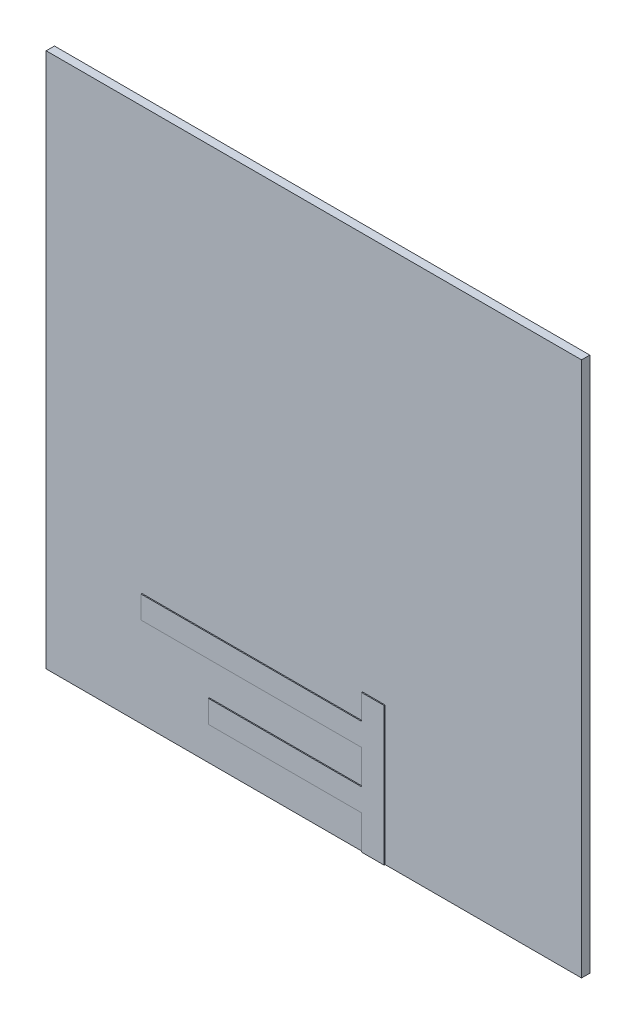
ISO-10303-21;
HEADER;
FILE_DESCRIPTION(('STEP AP214'),'2;1');
FILE_NAME('part.step','',(''),(''),'','','');
FILE_SCHEMA(('AUTOMOTIVE_DESIGN { 1 0 10303 214 1 1 1 1 }'));
ENDSEC;
DATA;
#1=APPLICATION_CONTEXT('core data for automotive mechanical design processes');
#2=APPLICATION_PROTOCOL_DEFINITION('international standard','automotive_design',2000,#1);
#3=PRODUCT_CONTEXT('',#1,'mechanical');
#4=PRODUCT('Part','Part','',(#3));
#5=PRODUCT_RELATED_PRODUCT_CATEGORY('part','',(#4));
#6=PRODUCT_DEFINITION_FORMATION('','',#4);
#7=PRODUCT_DEFINITION_CONTEXT('part definition',#1,'design');
#8=PRODUCT_DEFINITION('design','',#6,#7);
#9=PRODUCT_DEFINITION_SHAPE('','',#8);
#10=(LENGTH_UNIT() NAMED_UNIT(*) SI_UNIT(.MILLI.,.METRE.));
#11=(NAMED_UNIT(*) PLANE_ANGLE_UNIT() SI_UNIT($,.RADIAN.));
#12=(NAMED_UNIT(*) SI_UNIT($,.STERADIAN.) SOLID_ANGLE_UNIT());
#13=UNCERTAINTY_MEASURE_WITH_UNIT(LENGTH_MEASURE(1.E-05),#10,'distance_accuracy_value','');
#14=(GEOMETRIC_REPRESENTATION_CONTEXT(3) GLOBAL_UNCERTAINTY_ASSIGNED_CONTEXT((#13)) GLOBAL_UNIT_ASSIGNED_CONTEXT((#10,
#11,#12)) REPRESENTATION_CONTEXT('',''));
#15=CARTESIAN_POINT('',(0.,0.,0.));
#16=DIRECTION('',(0.,0.,1.));
#17=DIRECTION('',(1.,0.,0.));
#18=AXIS2_PLACEMENT_3D('',#15,#16,#17);
#19=CARTESIAN_POINT('',(-55.,55.,1.9));
#20=DIRECTION('',(1.,0.,0.));
#21=DIRECTION('',(0.,1.,0.));
#22=AXIS2_PLACEMENT_3D('',#19,#20,#21);
#23=PLANE('',#22);
#24=DIRECTION('',(0.,0.,-1.));
#25=VECTOR('',#24,1.);
#26=CARTESIAN_POINT('',(-55.,-55.,1.9));
#27=LINE('',#26,#25);
#28=CARTESIAN_POINT('',(-55.,-55.,1.7));
#29=VERTEX_POINT('',#28);
#30=CARTESIAN_POINT('',(-55.,-55.,0.));
#31=VERTEX_POINT('',#30);
#32=EDGE_CURVE('E11',#29,#31,#27,.T.);
#33=ORIENTED_EDGE('',*,*,#32,.F.);
#34=DIRECTION('',(0.,-1.,0.));
#35=VECTOR('',#34,1.);
#36=CARTESIAN_POINT('',(-55.,-55.,1.7));
#37=LINE('',#36,#35);
#38=CARTESIAN_POINT('',(-55.,55.,1.7));
#39=VERTEX_POINT('',#38);
#40=EDGE_CURVE('E224',#39,#29,#37,.T.);
#41=ORIENTED_EDGE('',*,*,#40,.F.);
#42=DIRECTION('',(0.,0.,-1.));
#43=VECTOR('',#42,1.);
#44=CARTESIAN_POINT('',(-55.,55.,1.9));
#45=LINE('',#44,#43);
#46=CARTESIAN_POINT('',(-55.,55.,0.));
#47=VERTEX_POINT('',#46);
#48=EDGE_CURVE('E61',#39,#47,#45,.T.);
#49=ORIENTED_EDGE('',*,*,#48,.T.);
#50=DIRECTION('',(0.,-1.,0.));
#51=VECTOR('',#50,1.);
#52=CARTESIAN_POINT('',(-55.,55.,0.));
#53=LINE('',#52,#51);
#54=EDGE_CURVE('E268',#47,#31,#53,.T.);
#55=ORIENTED_EDGE('',*,*,#54,.T.);
#56=EDGE_LOOP('',(#33,#41,#49,#55));
#57=FACE_BOUND('',#56,.T.);
#58=ADVANCED_FACE('F38',(#57),#23,.F.);
#59=CARTESIAN_POINT('',(-55.,-55.,1.9));
#60=DIRECTION('',(0.,1.,0.));
#61=DIRECTION('',(0.,0.,1.));
#62=AXIS2_PLACEMENT_3D('',#59,#60,#61);
#63=PLANE('',#62);
#64=DIRECTION('',(1.,0.,0.));
#65=VECTOR('',#64,1.);
#66=CARTESIAN_POINT('',(55.,-55.,1.7));
#67=LINE('',#66,#65);
#68=CARTESIAN_POINT('',(14.63,-55.,1.7));
#69=VERTEX_POINT('',#68);
#70=CARTESIAN_POINT('',(55.,-55.,1.7));
#71=VERTEX_POINT('',#70);
#72=EDGE_CURVE('E215',#69,#71,#67,.T.);
#73=ORIENTED_EDGE('',*,*,#72,.F.);
#74=DIRECTION('',(0.,0.,1.));
#75=VECTOR('',#74,1.);
#76=CARTESIAN_POINT('',(14.63,-55.,1.7));
#77=LINE('',#76,#75);
#78=CARTESIAN_POINT('',(14.63,-55.,1.9));
#79=VERTEX_POINT('',#78);
#80=EDGE_CURVE('E269',#69,#79,#77,.T.);
#81=ORIENTED_EDGE('',*,*,#80,.T.);
#82=DIRECTION('',(1.,0.,0.));
#83=VECTOR('',#82,1.);
#84=CARTESIAN_POINT('',(-55.,-55.,1.9));
#85=LINE('',#84,#83);
#86=CARTESIAN_POINT('',(9.99999999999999,-55.,1.9));
#87=VERTEX_POINT('',#86);
#88=EDGE_CURVE('E299',#87,#79,#85,.T.);
#89=ORIENTED_EDGE('',*,*,#88,.F.);
#90=DIRECTION('',(0.,0.,1.));
#91=VECTOR('',#90,1.);
#92=CARTESIAN_POINT('',(9.99999999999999,-55.,1.7));
#93=LINE('',#92,#91);
#94=CARTESIAN_POINT('',(9.99999999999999,-55.,1.7));
#95=VERTEX_POINT('',#94);
#96=EDGE_CURVE('E265',#95,#87,#93,.T.);
#97=ORIENTED_EDGE('',*,*,#96,.F.);
#98=DIRECTION('',(1.,0.,0.));
#99=VECTOR('',#98,1.);
#100=CARTESIAN_POINT('',(9.99999999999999,-55.,1.7));
#101=LINE('',#100,#99);
#102=EDGE_CURVE('E160',#29,#95,#101,.T.);
#103=ORIENTED_EDGE('',*,*,#102,.F.);
#104=ORIENTED_EDGE('',*,*,#32,.T.);
#105=DIRECTION('',(1.,0.,0.));
#106=VECTOR('',#105,1.);
#107=CARTESIAN_POINT('',(-55.,-55.,0.));
#108=LINE('',#107,#106);
#109=CARTESIAN_POINT('',(55.,-55.,0.));
#110=VERTEX_POINT('',#109);
#111=EDGE_CURVE('E306',#31,#110,#108,.T.);
#112=ORIENTED_EDGE('',*,*,#111,.T.);
#113=DIRECTION('',(0.,0.,-1.));
#114=VECTOR('',#113,1.);
#115=CARTESIAN_POINT('',(55.,-55.,1.9));
#116=LINE('',#115,#114);
#117=EDGE_CURVE('E46',#71,#110,#116,.T.);
#118=ORIENTED_EDGE('',*,*,#117,.F.);
#119=EDGE_LOOP('',(#73,#81,#89,#97,#103,#104,#112,#118));
#120=FACE_BOUND('',#119,.T.);
#121=ADVANCED_FACE('F331',(#120),#63,.F.);
#122=CARTESIAN_POINT('',(55.,55.,1.9));
#123=DIRECTION('',(-1.,0.,0.));
#124=DIRECTION('',(0.,-1.,0.));
#125=AXIS2_PLACEMENT_3D('',#122,#123,#124);
#126=PLANE('',#125);
#127=DIRECTION('',(0.,0.,-1.));
#128=VECTOR('',#127,1.);
#129=CARTESIAN_POINT('',(55.,55.,1.9));
#130=LINE('',#129,#128);
#131=CARTESIAN_POINT('',(55.,55.,1.7));
#132=VERTEX_POINT('',#131);
#133=CARTESIAN_POINT('',(55.,55.,0.));
#134=VERTEX_POINT('',#133);
#135=EDGE_CURVE('E318',#132,#134,#130,.T.);
#136=ORIENTED_EDGE('',*,*,#135,.F.);
#137=DIRECTION('',(0.,1.,0.));
#138=VECTOR('',#137,1.);
#139=CARTESIAN_POINT('',(55.,55.,1.7));
#140=LINE('',#139,#138);
#141=EDGE_CURVE('E218',#71,#132,#140,.T.);
#142=ORIENTED_EDGE('',*,*,#141,.F.);
#143=ORIENTED_EDGE('',*,*,#117,.T.);
#144=DIRECTION('',(0.,1.,0.));
#145=VECTOR('',#144,1.);
#146=CARTESIAN_POINT('',(55.,55.,0.));
#147=LINE('',#146,#145);
#148=EDGE_CURVE('E310',#110,#134,#147,.T.);
#149=ORIENTED_EDGE('',*,*,#148,.T.);
#150=EDGE_LOOP('',(#136,#142,#143,#149));
#151=FACE_BOUND('',#150,.T.);
#152=ADVANCED_FACE('F325',(#151),#126,.F.);
#153=CARTESIAN_POINT('',(-55.,55.,1.9));
#154=DIRECTION('',(0.,-1.,0.));
#155=DIRECTION('',(0.,0.,-1.));
#156=AXIS2_PLACEMENT_3D('',#153,#154,#155);
#157=PLANE('',#156);
#158=ORIENTED_EDGE('',*,*,#48,.F.);
#159=DIRECTION('',(-1.,0.,0.));
#160=VECTOR('',#159,1.);
#161=CARTESIAN_POINT('',(-55.,55.,1.7));
#162=LINE('',#161,#160);
#163=EDGE_CURVE('E221',#132,#39,#162,.T.);
#164=ORIENTED_EDGE('',*,*,#163,.F.);
#165=ORIENTED_EDGE('',*,*,#135,.T.);
#166=DIRECTION('',(-1.,0.,0.));
#167=VECTOR('',#166,1.);
#168=CARTESIAN_POINT('',(-55.,55.,0.));
#169=LINE('',#168,#167);
#170=EDGE_CURVE('E303',#134,#47,#169,.T.);
#171=ORIENTED_EDGE('',*,*,#170,.T.);
#172=EDGE_LOOP('',(#158,#164,#165,#171));
#173=FACE_BOUND('',#172,.T.);
#174=ADVANCED_FACE('F337',(#173),#157,.F.);
#175=CARTESIAN_POINT('',(0.,0.,1.9));
#176=DIRECTION('',(0.,0.,1.));
#177=DIRECTION('',(1.,0.,0.));
#178=AXIS2_PLACEMENT_3D('',#175,#176,#177);
#179=PLANE('',#178);
#180=DIRECTION('',(0.,1.,0.));
#181=VECTOR('',#180,1.);
#182=CARTESIAN_POINT('',(9.99999999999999,-48.005,1.9));
#183=LINE('',#182,#181);
#184=CARTESIAN_POINT('',(9.99999999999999,-48.005,1.9));
#185=VERTEX_POINT('',#184);
#186=EDGE_CURVE('E53',#87,#185,#183,.T.);
#187=ORIENTED_EDGE('',*,*,#186,.F.);
#188=ORIENTED_EDGE('',*,*,#88,.T.);
#189=DIRECTION('',(0.,-1.,0.));
#190=VECTOR('',#189,1.);
#191=CARTESIAN_POINT('',(14.63,-55.,1.9));
#192=LINE('',#191,#190);
#193=CARTESIAN_POINT('',(14.63,-26.5961070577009,1.9));
#194=VERTEX_POINT('',#193);
#195=EDGE_CURVE('E175',#194,#79,#192,.T.);
#196=ORIENTED_EDGE('',*,*,#195,.F.);
#197=DIRECTION('',(1.,0.,0.));
#198=VECTOR('',#197,1.);
#199=CARTESIAN_POINT('',(14.63,-26.5961070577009,1.9));
#200=LINE('',#199,#198);
#201=CARTESIAN_POINT('',(9.99999999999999,-26.5961070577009,1.9));
#202=VERTEX_POINT('',#201);
#203=EDGE_CURVE('E178',#202,#194,#200,.T.);
#204=ORIENTED_EDGE('',*,*,#203,.F.);
#205=DIRECTION('',(0.,1.,0.));
#206=VECTOR('',#205,1.);
#207=CARTESIAN_POINT('',(9.99999999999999,-26.5961070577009,1.9));
#208=LINE('',#207,#206);
#209=CARTESIAN_POINT('',(9.99999999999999,-31.735,1.9));
#210=VERTEX_POINT('',#209);
#211=EDGE_CURVE('E258',#210,#202,#208,.T.);
#212=ORIENTED_EDGE('',*,*,#211,.F.);
#213=DIRECTION('',(1.,0.,0.));
#214=VECTOR('',#213,1.);
#215=CARTESIAN_POINT('',(9.99999999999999,-31.735,1.9));
#216=LINE('',#215,#214);
#217=CARTESIAN_POINT('',(-35.33,-31.735,1.9));
#218=VERTEX_POINT('',#217);
#219=EDGE_CURVE('E254',#218,#210,#216,.T.);
#220=ORIENTED_EDGE('',*,*,#219,.F.);
#221=DIRECTION('',(0.,1.,0.));
#222=VECTOR('',#221,1.);
#223=CARTESIAN_POINT('',(-35.33,-31.735,1.9));
#224=LINE('',#223,#222);
#225=CARTESIAN_POINT('',(-35.33,-36.365,1.9));
#226=VERTEX_POINT('',#225);
#227=EDGE_CURVE('E250',#226,#218,#224,.T.);
#228=ORIENTED_EDGE('',*,*,#227,.F.);
#229=DIRECTION('',(-1.,0.,0.));
#230=VECTOR('',#229,1.);
#231=CARTESIAN_POINT('',(-35.33,-36.365,1.9));
#232=LINE('',#231,#230);
#233=CARTESIAN_POINT('',(10.,-36.365,1.9));
#234=VERTEX_POINT('',#233);
#235=EDGE_CURVE('E246',#234,#226,#232,.T.);
#236=ORIENTED_EDGE('',*,*,#235,.F.);
#237=DIRECTION('',(0.,1.,0.));
#238=VECTOR('',#237,1.);
#239=CARTESIAN_POINT('',(10.,-36.365,1.9));
#240=LINE('',#239,#238);
#241=CARTESIAN_POINT('',(9.99999999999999,-43.375,1.9));
#242=VERTEX_POINT('',#241);
#243=EDGE_CURVE('E242',#242,#234,#240,.T.);
#244=ORIENTED_EDGE('',*,*,#243,.F.);
#245=DIRECTION('',(1.,0.,0.));
#246=VECTOR('',#245,1.);
#247=CARTESIAN_POINT('',(9.99999999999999,-43.375,1.9));
#248=LINE('',#247,#246);
#249=CARTESIAN_POINT('',(-21.48,-43.375,1.9));
#250=VERTEX_POINT('',#249);
#251=EDGE_CURVE('E238',#250,#242,#248,.T.);
#252=ORIENTED_EDGE('',*,*,#251,.F.);
#253=DIRECTION('',(0.,1.,0.));
#254=VECTOR('',#253,1.);
#255=CARTESIAN_POINT('',(-21.48,-43.375,1.9));
#256=LINE('',#255,#254);
#257=CARTESIAN_POINT('',(-21.48,-48.005,1.9));
#258=VERTEX_POINT('',#257);
#259=EDGE_CURVE('E234',#258,#250,#256,.T.);
#260=ORIENTED_EDGE('',*,*,#259,.F.);
#261=DIRECTION('',(-1.,0.,0.));
#262=VECTOR('',#261,1.);
#263=CARTESIAN_POINT('',(-21.48,-48.005,1.9));
#264=LINE('',#263,#262);
#265=EDGE_CURVE('E231',#185,#258,#264,.T.);
#266=ORIENTED_EDGE('',*,*,#265,.F.);
#267=EDGE_LOOP('',(#187,#188,#196,#204,#212,#220,#228,#236,#244,#252,#260,#266));
#268=FACE_BOUND('',#267,.T.);
#269=ADVANCED_FACE('F350',(#268),#179,.T.);
#270=CARTESIAN_POINT('',(0.,0.,0.));
#271=DIRECTION('',(0.,0.,1.));
#272=DIRECTION('',(1.,0.,0.));
#273=AXIS2_PLACEMENT_3D('',#270,#271,#272);
#274=PLANE('',#273);
#275=ORIENTED_EDGE('',*,*,#54,.F.);
#276=ORIENTED_EDGE('',*,*,#170,.F.);
#277=ORIENTED_EDGE('',*,*,#148,.F.);
#278=ORIENTED_EDGE('',*,*,#111,.F.);
#279=EDGE_LOOP('',(#275,#276,#277,#278));
#280=FACE_BOUND('',#279,.T.);
#281=ADVANCED_FACE('F335',(#280),#274,.F.);
#282=CARTESIAN_POINT('',(9.99999999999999,-48.005,1.7));
#283=DIRECTION('',(1.,0.,0.));
#284=DIRECTION('',(0.,0.,-1.));
#285=AXIS2_PLACEMENT_3D('',#282,#283,#284);
#286=PLANE('',#285);
#287=ORIENTED_EDGE('',*,*,#186,.T.);
#288=DIRECTION('',(0.,0.,1.));
#289=VECTOR('',#288,1.);
#290=CARTESIAN_POINT('',(9.99999999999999,-48.005,1.7));
#291=LINE('',#290,#289);
#292=CARTESIAN_POINT('',(9.99999999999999,-48.005,1.7));
#293=VERTEX_POINT('',#292);
#294=EDGE_CURVE('E149',#293,#185,#291,.T.);
#295=ORIENTED_EDGE('',*,*,#294,.F.);
#296=DIRECTION('',(0.,1.,0.));
#297=VECTOR('',#296,1.);
#298=CARTESIAN_POINT('',(9.99999999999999,-48.005,1.7));
#299=LINE('',#298,#297);
#300=EDGE_CURVE('E153',#95,#293,#299,.T.);
#301=ORIENTED_EDGE('',*,*,#300,.F.);
#302=ORIENTED_EDGE('',*,*,#96,.T.);
#303=EDGE_LOOP('',(#287,#295,#301,#302));
#304=FACE_BOUND('',#303,.T.);
#305=ADVANCED_FACE('F151',(#304),#286,.F.);
#306=CARTESIAN_POINT('',(14.63,-55.,1.7));
#307=DIRECTION('',(-1.,0.,0.));
#308=DIRECTION('',(0.,0.,1.));
#309=AXIS2_PLACEMENT_3D('',#306,#307,#308);
#310=PLANE('',#309);
#311=ORIENTED_EDGE('',*,*,#195,.T.);
#312=ORIENTED_EDGE('',*,*,#80,.F.);
#313=DIRECTION('',(0.,-1.,0.));
#314=VECTOR('',#313,1.);
#315=CARTESIAN_POINT('',(14.63,-55.,1.7));
#316=LINE('',#315,#314);
#317=CARTESIAN_POINT('',(14.63,-26.5961070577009,1.7));
#318=VERTEX_POINT('',#317);
#319=EDGE_CURVE('E211',#318,#69,#316,.T.);
#320=ORIENTED_EDGE('',*,*,#319,.F.);
#321=DIRECTION('',(0.,0.,1.));
#322=VECTOR('',#321,1.);
#323=CARTESIAN_POINT('',(14.63,-26.5961070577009,1.7));
#324=LINE('',#323,#322);
#325=EDGE_CURVE('E273',#318,#194,#324,.T.);
#326=ORIENTED_EDGE('',*,*,#325,.T.);
#327=EDGE_LOOP('',(#311,#312,#320,#326));
#328=FACE_BOUND('',#327,.T.);
#329=ADVANCED_FACE('F358',(#328),#310,.F.);
#330=CARTESIAN_POINT('',(14.63,-26.5961070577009,1.7));
#331=DIRECTION('',(0.,-1.,0.));
#332=DIRECTION('',(0.,0.,-1.));
#333=AXIS2_PLACEMENT_3D('',#330,#331,#332);
#334=PLANE('',#333);
#335=ORIENTED_EDGE('',*,*,#203,.T.);
#336=ORIENTED_EDGE('',*,*,#325,.F.);
#337=DIRECTION('',(1.,0.,0.));
#338=VECTOR('',#337,1.);
#339=CARTESIAN_POINT('',(14.63,-26.5961070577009,1.7));
#340=LINE('',#339,#338);
#341=CARTESIAN_POINT('',(9.99999999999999,-26.5961070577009,1.7));
#342=VERTEX_POINT('',#341);
#343=EDGE_CURVE('E207',#342,#318,#340,.T.);
#344=ORIENTED_EDGE('',*,*,#343,.F.);
#345=DIRECTION('',(0.,0.,1.));
#346=VECTOR('',#345,1.);
#347=CARTESIAN_POINT('',(9.99999999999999,-26.5961070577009,1.7));
#348=LINE('',#347,#346);
#349=EDGE_CURVE('E276',#342,#202,#348,.T.);
#350=ORIENTED_EDGE('',*,*,#349,.T.);
#351=EDGE_LOOP('',(#335,#336,#344,#350));
#352=FACE_BOUND('',#351,.T.);
#353=ADVANCED_FACE('F388',(#352),#334,.F.);
#354=CARTESIAN_POINT('',(9.99999999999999,-26.5961070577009,1.7));
#355=DIRECTION('',(1.,0.,0.));
#356=DIRECTION('',(0.,0.,-1.));
#357=AXIS2_PLACEMENT_3D('',#354,#355,#356);
#358=PLANE('',#357);
#359=ORIENTED_EDGE('',*,*,#211,.T.);
#360=ORIENTED_EDGE('',*,*,#349,.F.);
#361=DIRECTION('',(0.,1.,0.));
#362=VECTOR('',#361,1.);
#363=CARTESIAN_POINT('',(9.99999999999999,-26.5961070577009,1.7));
#364=LINE('',#363,#362);
#365=CARTESIAN_POINT('',(9.99999999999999,-31.735,1.7));
#366=VERTEX_POINT('',#365);
#367=EDGE_CURVE('E203',#366,#342,#364,.T.);
#368=ORIENTED_EDGE('',*,*,#367,.F.);
#369=DIRECTION('',(0.,0.,1.));
#370=VECTOR('',#369,1.);
#371=CARTESIAN_POINT('',(9.99999999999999,-31.735,1.7));
#372=LINE('',#371,#370);
#373=EDGE_CURVE('E279',#366,#210,#372,.T.);
#374=ORIENTED_EDGE('',*,*,#373,.T.);
#375=EDGE_LOOP('',(#359,#360,#368,#374));
#376=FACE_BOUND('',#375,.T.);
#377=ADVANCED_FACE('F384',(#376),#358,.F.);
#378=CARTESIAN_POINT('',(9.99999999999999,-31.735,1.7));
#379=DIRECTION('',(0.,-1.,0.));
#380=DIRECTION('',(1.,0.,0.));
#381=AXIS2_PLACEMENT_3D('',#378,#379,#380);
#382=PLANE('',#381);
#383=ORIENTED_EDGE('',*,*,#219,.T.);
#384=ORIENTED_EDGE('',*,*,#373,.F.);
#385=DIRECTION('',(1.,0.,0.));
#386=VECTOR('',#385,1.);
#387=CARTESIAN_POINT('',(9.99999999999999,-31.735,1.7));
#388=LINE('',#387,#386);
#389=CARTESIAN_POINT('',(-35.33,-31.735,1.7));
#390=VERTEX_POINT('',#389);
#391=EDGE_CURVE('E199',#390,#366,#388,.T.);
#392=ORIENTED_EDGE('',*,*,#391,.F.);
#393=DIRECTION('',(0.,0.,1.));
#394=VECTOR('',#393,1.);
#395=CARTESIAN_POINT('',(-35.33,-31.735,1.7));
#396=LINE('',#395,#394);
#397=EDGE_CURVE('E282',#390,#218,#396,.T.);
#398=ORIENTED_EDGE('',*,*,#397,.T.);
#399=EDGE_LOOP('',(#383,#384,#392,#398));
#400=FACE_BOUND('',#399,.T.);
#401=ADVANCED_FACE('F380',(#400),#382,.F.);
#402=CARTESIAN_POINT('',(-35.33,-31.735,1.7));
#403=DIRECTION('',(1.,0.,0.));
#404=DIRECTION('',(0.,0.,-1.));
#405=AXIS2_PLACEMENT_3D('',#402,#403,#404);
#406=PLANE('',#405);
#407=ORIENTED_EDGE('',*,*,#227,.T.);
#408=ORIENTED_EDGE('',*,*,#397,.F.);
#409=DIRECTION('',(0.,1.,0.));
#410=VECTOR('',#409,1.);
#411=CARTESIAN_POINT('',(-35.33,-31.735,1.7));
#412=LINE('',#411,#410);
#413=CARTESIAN_POINT('',(-35.33,-36.365,1.7));
#414=VERTEX_POINT('',#413);
#415=EDGE_CURVE('E195',#414,#390,#412,.T.);
#416=ORIENTED_EDGE('',*,*,#415,.F.);
#417=DIRECTION('',(0.,0.,1.));
#418=VECTOR('',#417,1.);
#419=CARTESIAN_POINT('',(-35.33,-36.365,1.7));
#420=LINE('',#419,#418);
#421=EDGE_CURVE('E285',#414,#226,#420,.T.);
#422=ORIENTED_EDGE('',*,*,#421,.T.);
#423=EDGE_LOOP('',(#407,#408,#416,#422));
#424=FACE_BOUND('',#423,.T.);
#425=ADVANCED_FACE('F376',(#424),#406,.F.);
#426=CARTESIAN_POINT('',(-35.33,-36.365,1.7));
#427=DIRECTION('',(0.,1.,0.));
#428=DIRECTION('',(-1.,0.,0.));
#429=AXIS2_PLACEMENT_3D('',#426,#427,#428);
#430=PLANE('',#429);
#431=ORIENTED_EDGE('',*,*,#235,.T.);
#432=ORIENTED_EDGE('',*,*,#421,.F.);
#433=DIRECTION('',(-1.,0.,0.));
#434=VECTOR('',#433,1.);
#435=CARTESIAN_POINT('',(-35.33,-36.365,1.7));
#436=LINE('',#435,#434);
#437=CARTESIAN_POINT('',(10.,-36.365,1.7));
#438=VERTEX_POINT('',#437);
#439=EDGE_CURVE('E191',#438,#414,#436,.T.);
#440=ORIENTED_EDGE('',*,*,#439,.F.);
#441=DIRECTION('',(0.,0.,1.));
#442=VECTOR('',#441,1.);
#443=CARTESIAN_POINT('',(10.,-36.365,1.7));
#444=LINE('',#443,#442);
#445=EDGE_CURVE('E288',#438,#234,#444,.T.);
#446=ORIENTED_EDGE('',*,*,#445,.T.);
#447=EDGE_LOOP('',(#431,#432,#440,#446));
#448=FACE_BOUND('',#447,.T.);
#449=ADVANCED_FACE('F372',(#448),#430,.F.);
#450=CARTESIAN_POINT('',(10.,-36.365,1.7));
#451=DIRECTION('',(1.,0.,0.));
#452=DIRECTION('',(0.,1.,0.));
#453=AXIS2_PLACEMENT_3D('',#450,#451,#452);
#454=PLANE('',#453);
#455=ORIENTED_EDGE('',*,*,#243,.T.);
#456=ORIENTED_EDGE('',*,*,#445,.F.);
#457=DIRECTION('',(0.,1.,0.));
#458=VECTOR('',#457,1.);
#459=CARTESIAN_POINT('',(10.,-36.365,1.7));
#460=LINE('',#459,#458);
#461=CARTESIAN_POINT('',(9.99999999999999,-43.375,1.7));
#462=VERTEX_POINT('',#461);
#463=EDGE_CURVE('E187',#462,#438,#460,.T.);
#464=ORIENTED_EDGE('',*,*,#463,.F.);
#465=DIRECTION('',(0.,0.,1.));
#466=VECTOR('',#465,1.);
#467=CARTESIAN_POINT('',(9.99999999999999,-43.375,1.7));
#468=LINE('',#467,#466);
#469=EDGE_CURVE('E291',#462,#242,#468,.T.);
#470=ORIENTED_EDGE('',*,*,#469,.T.);
#471=EDGE_LOOP('',(#455,#456,#464,#470));
#472=FACE_BOUND('',#471,.T.);
#473=ADVANCED_FACE('F368',(#472),#454,.F.);
#474=CARTESIAN_POINT('',(9.99999999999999,-43.375,1.7));
#475=DIRECTION('',(0.,-1.,0.));
#476=DIRECTION('',(0.,0.,-1.));
#477=AXIS2_PLACEMENT_3D('',#474,#475,#476);
#478=PLANE('',#477);
#479=ORIENTED_EDGE('',*,*,#251,.T.);
#480=ORIENTED_EDGE('',*,*,#469,.F.);
#481=DIRECTION('',(1.,0.,0.));
#482=VECTOR('',#481,1.);
#483=CARTESIAN_POINT('',(9.99999999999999,-43.375,1.7));
#484=LINE('',#483,#482);
#485=CARTESIAN_POINT('',(-21.48,-43.375,1.7));
#486=VERTEX_POINT('',#485);
#487=EDGE_CURVE('E183',#486,#462,#484,.T.);
#488=ORIENTED_EDGE('',*,*,#487,.F.);
#489=DIRECTION('',(0.,0.,1.));
#490=VECTOR('',#489,1.);
#491=CARTESIAN_POINT('',(-21.48,-43.375,1.7));
#492=LINE('',#491,#490);
#493=EDGE_CURVE('E294',#486,#250,#492,.T.);
#494=ORIENTED_EDGE('',*,*,#493,.T.);
#495=EDGE_LOOP('',(#479,#480,#488,#494));
#496=FACE_BOUND('',#495,.T.);
#497=ADVANCED_FACE('F364',(#496),#478,.F.);
#498=CARTESIAN_POINT('',(-21.48,-43.375,1.7));
#499=DIRECTION('',(1.,0.,0.));
#500=DIRECTION('',(0.,0.,-1.));
#501=AXIS2_PLACEMENT_3D('',#498,#499,#500);
#502=PLANE('',#501);
#503=ORIENTED_EDGE('',*,*,#259,.T.);
#504=ORIENTED_EDGE('',*,*,#493,.F.);
#505=DIRECTION('',(0.,1.,0.));
#506=VECTOR('',#505,1.);
#507=CARTESIAN_POINT('',(-21.48,-43.375,1.7));
#508=LINE('',#507,#506);
#509=CARTESIAN_POINT('',(-21.48,-48.005,1.7));
#510=VERTEX_POINT('',#509);
#511=EDGE_CURVE('E169',#510,#486,#508,.T.);
#512=ORIENTED_EDGE('',*,*,#511,.F.);
#513=DIRECTION('',(0.,0.,1.));
#514=VECTOR('',#513,1.);
#515=CARTESIAN_POINT('',(-21.48,-48.005,1.7));
#516=LINE('',#515,#514);
#517=EDGE_CURVE('E159',#510,#258,#516,.T.);
#518=ORIENTED_EDGE('',*,*,#517,.T.);
#519=EDGE_LOOP('',(#503,#504,#512,#518));
#520=FACE_BOUND('',#519,.T.);
#521=ADVANCED_FACE('F361',(#520),#502,.F.);
#522=CARTESIAN_POINT('',(-21.48,-48.005,1.7));
#523=DIRECTION('',(0.,1.,0.));
#524=DIRECTION('',(0.,0.,1.));
#525=AXIS2_PLACEMENT_3D('',#522,#523,#524);
#526=PLANE('',#525);
#527=ORIENTED_EDGE('',*,*,#265,.T.);
#528=ORIENTED_EDGE('',*,*,#517,.F.);
#529=DIRECTION('',(-1.,0.,0.));
#530=VECTOR('',#529,1.);
#531=CARTESIAN_POINT('',(-21.48,-48.005,1.7));
#532=LINE('',#531,#530);
#533=EDGE_CURVE('E163',#293,#510,#532,.T.);
#534=ORIENTED_EDGE('',*,*,#533,.F.);
#535=ORIENTED_EDGE('',*,*,#294,.T.);
#536=EDGE_LOOP('',(#527,#528,#534,#535));
#537=FACE_BOUND('',#536,.T.);
#538=ADVANCED_FACE('F164',(#537),#526,.F.);
#539=CARTESIAN_POINT('',(0.,0.,1.7));
#540=DIRECTION('',(0.,0.,-1.));
#541=DIRECTION('',(-1.,0.,0.));
#542=AXIS2_PLACEMENT_3D('',#539,#540,#541);
#543=PLANE('',#542);
#544=ORIENTED_EDGE('',*,*,#300,.T.);
#545=ORIENTED_EDGE('',*,*,#533,.T.);
#546=ORIENTED_EDGE('',*,*,#511,.T.);
#547=ORIENTED_EDGE('',*,*,#487,.T.);
#548=ORIENTED_EDGE('',*,*,#463,.T.);
#549=ORIENTED_EDGE('',*,*,#439,.T.);
#550=ORIENTED_EDGE('',*,*,#415,.T.);
#551=ORIENTED_EDGE('',*,*,#391,.T.);
#552=ORIENTED_EDGE('',*,*,#367,.T.);
#553=ORIENTED_EDGE('',*,*,#343,.T.);
#554=ORIENTED_EDGE('',*,*,#319,.T.);
#555=ORIENTED_EDGE('',*,*,#72,.T.);
#556=ORIENTED_EDGE('',*,*,#141,.T.);
#557=ORIENTED_EDGE('',*,*,#163,.T.);
#558=ORIENTED_EDGE('',*,*,#40,.T.);
#559=ORIENTED_EDGE('',*,*,#102,.T.);
#560=EDGE_LOOP('',(#544,#545,#546,#547,#548,#549,#550,#551,#552,#553,#554,#555,#556,#557,#558,#559));
#561=FACE_BOUND('',#560,.T.);
#562=ADVANCED_FACE('F171',(#561),#543,.F.);
#563=CLOSED_SHELL('',(#58,#121,#152,#174,#269,#281,#305,#329,#353,#377,#401,#425,#449,#473,#497,
#521,#538,#562));
#564=MANIFOLD_SOLID_BREP('B2',#563);
#565=ADVANCED_BREP_SHAPE_REPRESENTATION('',(#18,#564),#14);
#566=SHAPE_DEFINITION_REPRESENTATION(#9,#565);
ENDSEC;
END-ISO-10303-21;
